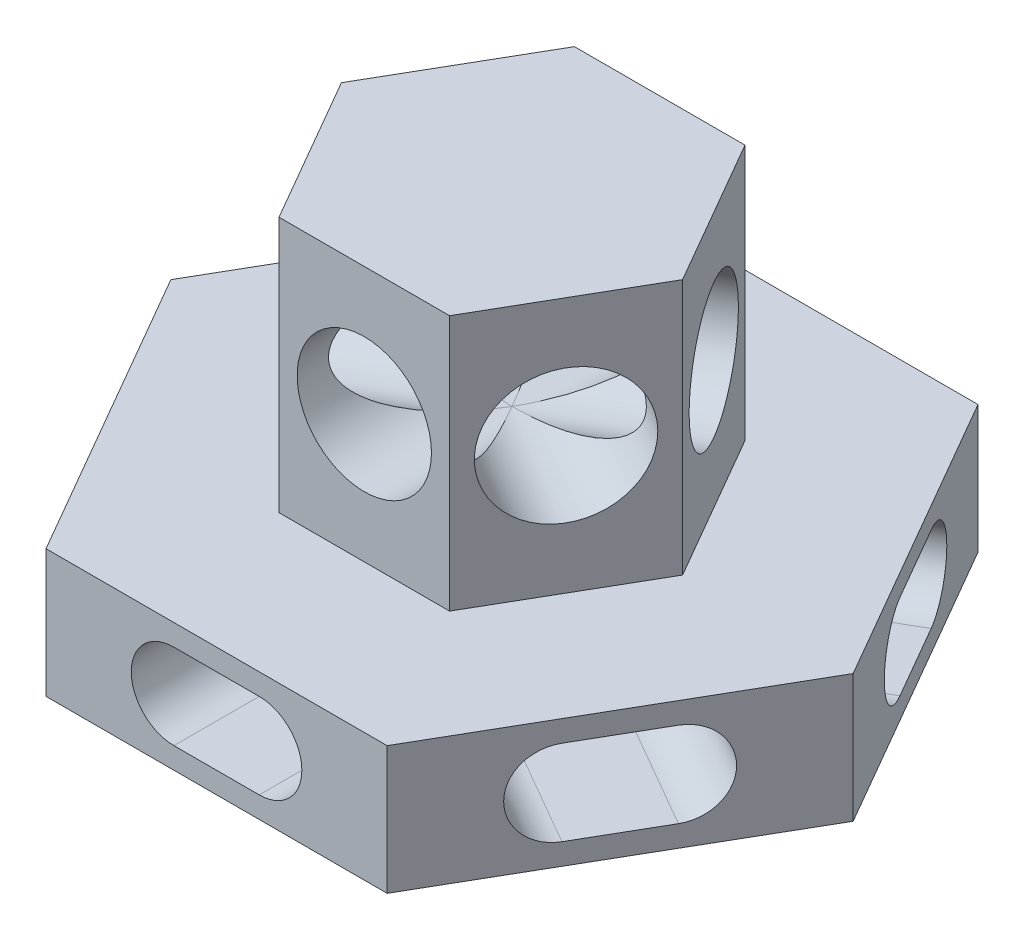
from build123d import *

# Parameters (mm, degrees)
SALIENTE_EXTRUIR1_DEPTH = 30
SALIENTE_EXTRUIR2_DEPTH = 90
CORTAR_EXTRUIR1_REACH   = 198.214
MATRIZC1_COUNT          = 6
CORTAR_EXTRUIR2_REACH   = 168.433
CROQUIS4_R              = 15.75
MATRIZC2_COUNT          = 6


with BuildPart() as part:
    # Croquis1 → Saliente-Extruir1 (new body)
    with BuildSketch(Plane(origin=(0, 0, 0), x_dir=(1, 0, 0), z_dir=(0, 1, 0))):
        Polygon((40, 69.282032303), (-40, 69.282032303), (-80, 0), (-40, -69.282032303), (40, -69.282032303), (80, 0), align=None)
    extrude(amount=SALIENTE_EXTRUIR1_DEPTH)

    # Croquis2 → Saliente-Extruir2 (add)
    with BuildSketch(Plane(origin=(0, 0, 0), x_dir=(1, 0, 0), z_dir=(0, 1, 0))):
        Polygon((20, 34.641016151), (-20, 34.641016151), (-40, 0), (-20, -34.641016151), (20, -34.641016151), (40, 0), align=None)
    extrude(amount=SALIENTE_EXTRUIR2_DEPTH)

    # Croquis3 → Cortar-Extruir1 (cut, up to next)
    with BuildSketch(Plane(origin=(60, 0, 34.641016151), x_dir=(0.5, 0, -0.8660254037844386), z_dir=(0.8660254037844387, 0, 0.5000000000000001)), mode=Mode.PRIVATE) as cortar_extruir1_sk1:
        with BuildLine():
            Line((-10, 25), (10, 25))
            ThreePointArc((10, 25), (20, 15), (10, 5))
            Line((10, 5), (-10, 5))
            ThreePointArc((-10, 5), (-20, 15), (-10, 25))
        make_face()
    cortar_extruir1_tool1 = extrude(cortar_extruir1_sk1.sketch, amount=-CORTAR_EXTRUIR1_REACH, mode=Mode.PRIVATE) & part.part
    cortar_extruir1 = cortar_extruir1_tool1.solids().sort_by_distance((60, 15, 34.641016))[0]
    add(cortar_extruir1, mode=Mode.SUBTRACT)

    # MatrizC1: Cortar-Extruir1 ×6 about axis
    matrizc1_axis = Axis((0, 0, 0), (0, 1, 0))
    for i in range(1, MATRIZC1_COUNT):
        add(cortar_extruir1.rotate(matrizc1_axis, i * 360 / MATRIZC1_COUNT), mode=Mode.SUBTRACT)

    # Croquis4 → Cortar-Extruir2 (cut, up to next)
    with BuildSketch(Plane(origin=(30, 0, -17.320508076), x_dir=(-0.5000000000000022, 0, -0.8660254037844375), z_dir=(0.8660254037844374, 0, -0.5000000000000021)), mode=Mode.PRIVATE) as cortar_extruir2_sk1:
        with Locations((0, 60)):
            Circle(CROQUIS4_R)
    cortar_extruir2_tool1 = extrude(cortar_extruir2_sk1.sketch, amount=-CORTAR_EXTRUIR2_REACH, mode=Mode.PRIVATE) & part.part
    cortar_extruir2 = cortar_extruir2_tool1.solids().sort_by_distance((30, 60, -17.320508))[0]
    add(cortar_extruir2, mode=Mode.SUBTRACT)

    # MatrizC2: Cortar-Extruir2 ×6 about axis
    matrizc2_axis = Axis((0, 90, 0), (0, 1, 0))
    for i in range(1, MATRIZC2_COUNT):
        add(cortar_extruir2.rotate(matrizc2_axis, i * 360 / MATRIZC2_COUNT), mode=Mode.SUBTRACT)


solid = part.part
